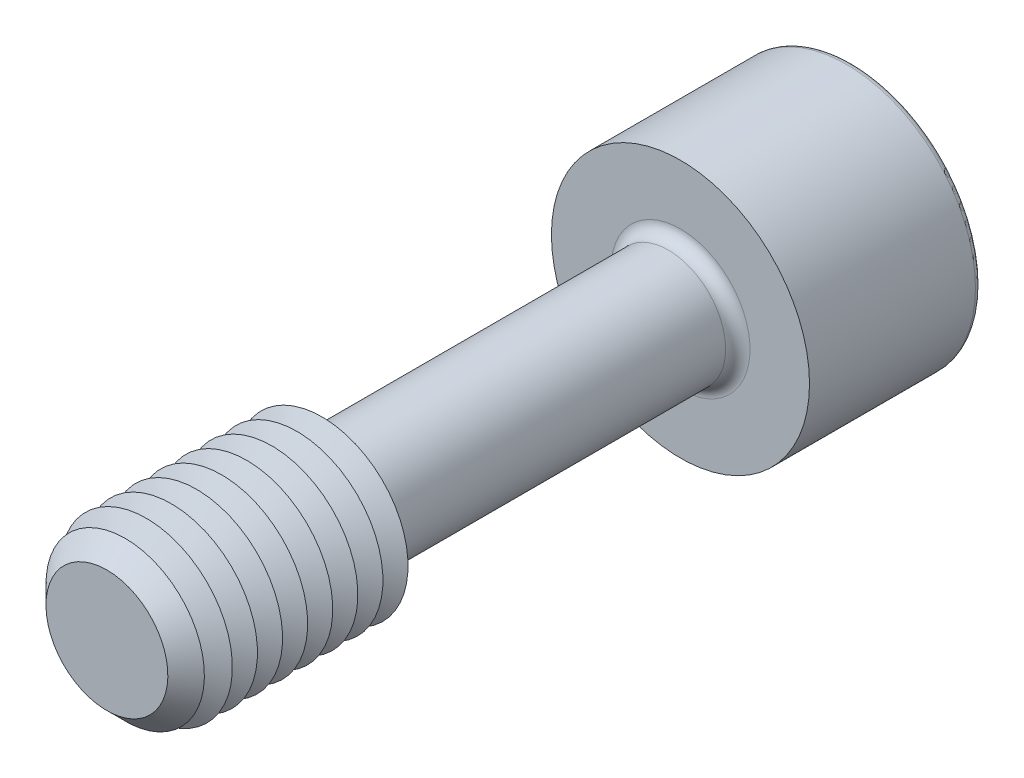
ISO-10303-21;
HEADER;
FILE_DESCRIPTION(('STEP AP214'),'2;1');
FILE_NAME('part.step','',(''),(''),'','','');
FILE_SCHEMA(('AUTOMOTIVE_DESIGN { 1 0 10303 214 1 1 1 1 }'));
ENDSEC;
DATA;
#1=APPLICATION_CONTEXT('core data for automotive mechanical design processes');
#2=APPLICATION_PROTOCOL_DEFINITION('international standard','automotive_design',2000,#1);
#3=PRODUCT_CONTEXT('',#1,'mechanical');
#4=PRODUCT('Part','Part','',(#3));
#5=PRODUCT_RELATED_PRODUCT_CATEGORY('part','',(#4));
#6=PRODUCT_DEFINITION_FORMATION('','',#4);
#7=PRODUCT_DEFINITION_CONTEXT('part definition',#1,'design');
#8=PRODUCT_DEFINITION('design','',#6,#7);
#9=PRODUCT_DEFINITION_SHAPE('','',#8);
#10=(LENGTH_UNIT() NAMED_UNIT(*) SI_UNIT(.MILLI.,.METRE.));
#11=(NAMED_UNIT(*) PLANE_ANGLE_UNIT() SI_UNIT($,.RADIAN.));
#12=(NAMED_UNIT(*) SI_UNIT($,.STERADIAN.) SOLID_ANGLE_UNIT());
#13=UNCERTAINTY_MEASURE_WITH_UNIT(LENGTH_MEASURE(1.E-05),#10,'distance_accuracy_value','');
#14=(GEOMETRIC_REPRESENTATION_CONTEXT(3) GLOBAL_UNCERTAINTY_ASSIGNED_CONTEXT((#13)) GLOBAL_UNIT_ASSIGNED_CONTEXT((#10,
#11,#12)) REPRESENTATION_CONTEXT('',''));
#15=CARTESIAN_POINT('',(0.,0.,0.));
#16=DIRECTION('',(0.,0.,1.));
#17=DIRECTION('',(1.,0.,0.));
#18=AXIS2_PLACEMENT_3D('',#15,#16,#17);
#19=CARTESIAN_POINT('',(-2.88675134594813,-5.,-22.));
#20=DIRECTION('',(0.,0.,1.));
#21=DIRECTION('',(1.,0.,0.));
#22=AXIS2_PLACEMENT_3D('',#19,#20,#21);
#23=PLANE('',#22);
#24=DIRECTION('',(1.,0.,0.));
#25=VECTOR('',#24,1.);
#26=CARTESIAN_POINT('',(-2.88675134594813,-5.,-22.));
#27=LINE('',#26,#25);
#28=CARTESIAN_POINT('',(0.,-5.,-22.));
#29=VERTEX_POINT('',#28);
#30=CARTESIAN_POINT('',(2.88675134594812,-5.,-22.));
#31=VERTEX_POINT('',#30);
#32=EDGE_CURVE('E761',#29,#31,#27,.T.);
#33=ORIENTED_EDGE('',*,*,#32,.F.);
#34=CARTESIAN_POINT('',(0.,0.,-22.));
#35=DIRECTION('',(0.,0.,1.));
#36=DIRECTION('',(0.,-1.,0.));
#37=AXIS2_PLACEMENT_3D('',#34,#35,#36);
#38=CIRCLE('',#37,5.);
#39=CARTESIAN_POINT('',(4.3301270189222,-2.5,-22.));
#40=VERTEX_POINT('',#39);
#41=EDGE_CURVE('E53',#29,#40,#38,.T.);
#42=ORIENTED_EDGE('',*,*,#41,.T.);
#43=DIRECTION('',(0.5,0.866025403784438,0.));
#44=VECTOR('',#43,1.);
#45=CARTESIAN_POINT('',(2.88675134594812,-5.,-22.));
#46=LINE('',#45,#44);
#47=EDGE_CURVE('E746',#31,#40,#46,.T.);
#48=ORIENTED_EDGE('',*,*,#47,.F.);
#49=EDGE_LOOP('',(#33,#42,#48));
#50=FACE_BOUND('',#49,.T.);
#51=ADVANCED_FACE('F41',(#50),#23,.F.);
#52=CARTESIAN_POINT('',(5.77350269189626,0.,-22.));
#53=VERTEX_POINT('',#52);
#54=EDGE_CURVE('E757',#40,#53,#46,.T.);
#55=ORIENTED_EDGE('',*,*,#54,.F.);
#56=CARTESIAN_POINT('',(4.3301270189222,2.50000000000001,-22.));
#57=VERTEX_POINT('',#56);
#58=EDGE_CURVE('E11',#40,#57,#38,.T.);
#59=ORIENTED_EDGE('',*,*,#58,.T.);
#60=DIRECTION('',(-0.5,0.866025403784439,0.));
#61=VECTOR('',#60,1.);
#62=CARTESIAN_POINT('',(5.77350269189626,0.,-22.));
#63=LINE('',#62,#61);
#64=EDGE_CURVE('E745',#53,#57,#63,.T.);
#65=ORIENTED_EDGE('',*,*,#64,.F.);
#66=EDGE_LOOP('',(#55,#59,#65));
#67=FACE_BOUND('',#66,.T.);
#68=ADVANCED_FACE('F133',(#67),#23,.F.);
#69=CARTESIAN_POINT('',(2.88675134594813,5.,-22.));
#70=VERTEX_POINT('',#69);
#71=EDGE_CURVE('E741',#57,#70,#63,.T.);
#72=ORIENTED_EDGE('',*,*,#71,.F.);
#73=CARTESIAN_POINT('',(0.,5.00000000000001,-22.));
#74=VERTEX_POINT('',#73);
#75=EDGE_CURVE('E51',#57,#74,#38,.T.);
#76=ORIENTED_EDGE('',*,*,#75,.T.);
#77=DIRECTION('',(-1.,0.,0.));
#78=VECTOR('',#77,1.);
#79=CARTESIAN_POINT('',(2.88675134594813,5.,-22.));
#80=LINE('',#79,#78);
#81=EDGE_CURVE('E177',#70,#74,#80,.T.);
#82=ORIENTED_EDGE('',*,*,#81,.F.);
#83=EDGE_LOOP('',(#72,#76,#82));
#84=FACE_BOUND('',#83,.T.);
#85=ADVANCED_FACE('F139',(#84),#23,.F.);
#86=CARTESIAN_POINT('',(-2.88675134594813,5.,-22.));
#87=VERTEX_POINT('',#86);
#88=EDGE_CURVE('E751',#74,#87,#80,.T.);
#89=ORIENTED_EDGE('',*,*,#88,.F.);
#90=CARTESIAN_POINT('',(-4.3301270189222,2.50000000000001,-22.));
#91=VERTEX_POINT('',#90);
#92=EDGE_CURVE('E264',#74,#91,#38,.T.);
#93=ORIENTED_EDGE('',*,*,#92,.T.);
#94=DIRECTION('',(-0.5,-0.866025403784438,0.));
#95=VECTOR('',#94,1.);
#96=CARTESIAN_POINT('',(-2.88675134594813,5.,-22.));
#97=LINE('',#96,#95);
#98=EDGE_CURVE('E176',#87,#91,#97,.T.);
#99=ORIENTED_EDGE('',*,*,#98,.F.);
#100=EDGE_LOOP('',(#89,#93,#99));
#101=FACE_BOUND('',#100,.T.);
#102=ADVANCED_FACE('F157',(#101),#23,.F.);
#103=CARTESIAN_POINT('',(-5.77350269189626,0.,-22.));
#104=VERTEX_POINT('',#103);
#105=EDGE_CURVE('E170',#91,#104,#97,.T.);
#106=ORIENTED_EDGE('',*,*,#105,.F.);
#107=CARTESIAN_POINT('',(-4.3301270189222,-2.5,-22.));
#108=VERTEX_POINT('',#107);
#109=EDGE_CURVE('E172',#91,#108,#38,.T.);
#110=ORIENTED_EDGE('',*,*,#109,.T.);
#111=DIRECTION('',(0.5,-0.866025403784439,0.));
#112=VECTOR('',#111,1.);
#113=CARTESIAN_POINT('',(-5.77350269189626,0.,-22.));
#114=LINE('',#113,#112);
#115=EDGE_CURVE('E174',#104,#108,#114,.T.);
#116=ORIENTED_EDGE('',*,*,#115,.F.);
#117=EDGE_LOOP('',(#106,#110,#116));
#118=FACE_BOUND('',#117,.T.);
#119=ADVANCED_FACE('F146',(#118),#23,.F.);
#120=CARTESIAN_POINT('',(0.,0.,-32.));
#121=DIRECTION('',(0.,0.,-1.));
#122=DIRECTION('',(-1.,0.,0.));
#123=AXIS2_PLACEMENT_3D('',#120,#121,#122);
#124=PLANE('',#123);
#125=CARTESIAN_POINT('',(0.,0.,-32.));
#126=DIRECTION('',(0.,0.,-1.));
#127=DIRECTION('',(-1.,0.,0.));
#128=AXIS2_PLACEMENT_3D('',#125,#126,#127);
#129=CIRCLE('',#128,8.575);
#130=CARTESIAN_POINT('',(-8.575,0.,-32.));
#131=VERTEX_POINT('',#130);
#132=EDGE_CURVE('E250',#131,#131,#129,.T.);
#133=ORIENTED_EDGE('',*,*,#132,.T.);
#134=EDGE_LOOP('',(#133));
#135=FACE_BOUND('',#134,.T.);
#136=DIRECTION('',(-0.5,-0.866025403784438,0.));
#137=VECTOR('',#136,1.);
#138=CARTESIAN_POINT('',(-2.88675134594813,5.,-32.));
#139=LINE('',#138,#137);
#140=CARTESIAN_POINT('',(-2.88675134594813,5.,-32.));
#141=VERTEX_POINT('',#140);
#142=CARTESIAN_POINT('',(-5.77350269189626,0.,-32.));
#143=VERTEX_POINT('',#142);
#144=EDGE_CURVE('E212',#141,#143,#139,.T.);
#145=ORIENTED_EDGE('',*,*,#144,.T.);
#146=DIRECTION('',(0.5,-0.866025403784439,0.));
#147=VECTOR('',#146,1.);
#148=CARTESIAN_POINT('',(-5.77350269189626,0.,-32.));
#149=LINE('',#148,#147);
#150=CARTESIAN_POINT('',(-2.88675134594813,-5.,-32.));
#151=VERTEX_POINT('',#150);
#152=EDGE_CURVE('E67',#143,#151,#149,.T.);
#153=ORIENTED_EDGE('',*,*,#152,.T.);
#154=DIRECTION('',(1.,0.,0.));
#155=VECTOR('',#154,1.);
#156=CARTESIAN_POINT('',(-2.88675134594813,-5.,-32.));
#157=LINE('',#156,#155);
#158=CARTESIAN_POINT('',(2.88675134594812,-5.,-32.));
#159=VERTEX_POINT('',#158);
#160=EDGE_CURVE('E196',#151,#159,#157,.T.);
#161=ORIENTED_EDGE('',*,*,#160,.T.);
#162=DIRECTION('',(0.5,0.866025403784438,0.));
#163=VECTOR('',#162,1.);
#164=CARTESIAN_POINT('',(2.88675134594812,-5.,-32.));
#165=LINE('',#164,#163);
#166=CARTESIAN_POINT('',(5.77350269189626,0.,-32.));
#167=VERTEX_POINT('',#166);
#168=EDGE_CURVE('E200',#159,#167,#165,.T.);
#169=ORIENTED_EDGE('',*,*,#168,.T.);
#170=DIRECTION('',(-0.5,0.866025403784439,0.));
#171=VECTOR('',#170,1.);
#172=CARTESIAN_POINT('',(5.77350269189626,0.,-32.));
#173=LINE('',#172,#171);
#174=CARTESIAN_POINT('',(2.88675134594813,5.,-32.));
#175=VERTEX_POINT('',#174);
#176=EDGE_CURVE('E204',#167,#175,#173,.T.);
#177=ORIENTED_EDGE('',*,*,#176,.T.);
#178=DIRECTION('',(-1.,0.,0.));
#179=VECTOR('',#178,1.);
#180=CARTESIAN_POINT('',(2.88675134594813,5.,-32.));
#181=LINE('',#180,#179);
#182=EDGE_CURVE('E208',#175,#141,#181,.T.);
#183=ORIENTED_EDGE('',*,*,#182,.T.);
#184=EDGE_LOOP('',(#145,#153,#161,#169,#177,#183));
#185=FACE_BOUND('',#184,.T.);
#186=ADVANCED_FACE('F156',(#135,#185),#124,.T.);
#187=CARTESIAN_POINT('',(0.,0.,20.));
#188=DIRECTION('',(0.,0.,-1.));
#189=DIRECTION('',(-1.,0.,0.));
#190=AXIS2_PLACEMENT_3D('',#187,#188,#189);
#191=CYLINDRICAL_SURFACE('',#190,4.);
#192=CARTESIAN_POINT('',(0.,0.,-19.15));
#193=DIRECTION('',(0.,0.,-1.));
#194=DIRECTION('',(-1.,0.,0.));
#195=AXIS2_PLACEMENT_3D('',#192,#193,#194);
#196=CIRCLE('',#195,4.);
#197=CARTESIAN_POINT('',(-4.,0.,-19.15));
#198=VERTEX_POINT('',#197);
#199=EDGE_CURVE('E246',#198,#198,#196,.F.);
#200=ORIENTED_EDGE('',*,*,#199,.T.);
#201=EDGE_LOOP('',(#200));
#202=FACE_BOUND('',#201,.T.);
#203=CARTESIAN_POINT('',(0.,0.,3.84529946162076));
#204=DIRECTION('',(0.,0.,-1.));
#205=DIRECTION('',(0.,1.,0.));
#206=AXIS2_PLACEMENT_3D('',#203,#204,#205);
#207=CIRCLE('',#206,4.);
#208=CARTESIAN_POINT('',(0.,4.,3.84529946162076));
#209=VERTEX_POINT('',#208);
#210=EDGE_CURVE('E234',#209,#209,#207,.T.);
#211=ORIENTED_EDGE('',*,*,#210,.T.);
#212=EDGE_LOOP('',(#211));
#213=FACE_BOUND('',#212,.T.);
#214=ADVANCED_FACE('F163',(#202,#213),#191,.T.);
#215=CARTESIAN_POINT('',(0.,0.,3.84529946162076));
#216=DIRECTION('',(0.,0.,1.));
#217=DIRECTION('',(0.,-1.,0.));
#218=AXIS2_PLACEMENT_3D('',#215,#216,#217);
#219=CONICAL_SURFACE('',#218,4.,1.0471975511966);
#220=CARTESIAN_POINT('',(0.,0.,5.));
#221=DIRECTION('',(0.,0.,-1.));
#222=DIRECTION('',(-1.,0.,0.));
#223=AXIS2_PLACEMENT_3D('',#220,#221,#222);
#224=CIRCLE('',#223,6.);
#225=CARTESIAN_POINT('',(-6.,0.,5.));
#226=VERTEX_POINT('',#225);
#227=EDGE_CURVE('E268',#226,#226,#224,.T.);
#228=ORIENTED_EDGE('',*,*,#227,.T.);
#229=EDGE_LOOP('',(#228));
#230=FACE_BOUND('',#229,.T.);
#231=ORIENTED_EDGE('',*,*,#210,.F.);
#232=EDGE_LOOP('',(#231));
#233=FACE_BOUND('',#232,.T.);
#234=ADVANCED_FACE('F510',(#230,#233),#219,.T.);
#235=CARTESIAN_POINT('',(0.,0.,-20.));
#236=DIRECTION('',(0.,0.,-1.));
#237=DIRECTION('',(-1.,0.,0.));
#238=AXIS2_PLACEMENT_3D('',#235,#236,#237);
#239=PLANE('',#238);
#240=CARTESIAN_POINT('',(0.,0.,-20.));
#241=DIRECTION('',(0.,0.,-1.));
#242=DIRECTION('',(-1.,0.,0.));
#243=AXIS2_PLACEMENT_3D('',#240,#241,#242);
#244=CIRCLE('',#243,4.85);
#245=CARTESIAN_POINT('',(-4.85,0.,-20.));
#246=VERTEX_POINT('',#245);
#247=EDGE_CURVE('E242',#246,#246,#244,.T.);
#248=ORIENTED_EDGE('',*,*,#247,.T.);
#249=EDGE_LOOP('',(#248));
#250=FACE_BOUND('',#249,.T.);
#251=CARTESIAN_POINT('',(0.,0.,-20.));
#252=DIRECTION('',(0.,0.,-1.));
#253=DIRECTION('',(-1.,0.,0.));
#254=AXIS2_PLACEMENT_3D('',#251,#252,#253);
#255=CIRCLE('',#254,9.);
#256=CARTESIAN_POINT('',(-9.,0.,-20.));
#257=VERTEX_POINT('',#256);
#258=EDGE_CURVE('E230',#257,#257,#255,.T.);
#259=ORIENTED_EDGE('',*,*,#258,.F.);
#260=EDGE_LOOP('',(#259));
#261=FACE_BOUND('',#260,.T.);
#262=ADVANCED_FACE('F503',(#250,#261),#239,.F.);
#263=CARTESIAN_POINT('',(0.,0.,-32.));
#264=DIRECTION('',(0.,0.,1.));
#265=DIRECTION('',(1.,0.,0.));
#266=AXIS2_PLACEMENT_3D('',#263,#264,#265);
#267=CYLINDRICAL_SURFACE('',#266,9.);
#268=CARTESIAN_POINT('',(0.,0.,-31.575));
#269=DIRECTION('',(0.,0.,-1.));
#270=DIRECTION('',(-1.,0.,0.));
#271=AXIS2_PLACEMENT_3D('',#268,#269,#270);
#272=CIRCLE('',#271,9.);
#273=CARTESIAN_POINT('',(-9.,0.,-31.575));
#274=VERTEX_POINT('',#273);
#275=EDGE_CURVE('E253',#274,#274,#272,.F.);
#276=ORIENTED_EDGE('',*,*,#275,.T.);
#277=EDGE_LOOP('',(#276));
#278=FACE_BOUND('',#277,.T.);
#279=ORIENTED_EDGE('',*,*,#258,.T.);
#280=EDGE_LOOP('',(#279));
#281=FACE_BOUND('',#280,.T.);
#282=ADVANCED_FACE('F509',(#278,#281),#267,.T.);
#283=CARTESIAN_POINT('',(-5.77350269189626,0.,-22.));
#284=DIRECTION('',(0.866025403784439,0.5,0.));
#285=DIRECTION('',(-0.5,0.866025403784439,0.));
#286=AXIS2_PLACEMENT_3D('',#283,#284,#285);
#287=PLANE('',#286);
#288=ORIENTED_EDGE('',*,*,#152,.F.);
#289=DIRECTION('',(0.,0.,-1.));
#290=VECTOR('',#289,1.);
#291=CARTESIAN_POINT('',(-5.77350269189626,0.,-22.));
#292=LINE('',#291,#290);
#293=EDGE_CURVE('E186',#104,#143,#292,.T.);
#294=ORIENTED_EDGE('',*,*,#293,.F.);
#295=ORIENTED_EDGE('',*,*,#115,.T.);
#296=CARTESIAN_POINT('',(-2.88675134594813,-5.,-22.));
#297=VERTEX_POINT('',#296);
#298=EDGE_CURVE('E215',#108,#297,#114,.T.);
#299=ORIENTED_EDGE('',*,*,#298,.T.);
#300=DIRECTION('',(0.,0.,-1.));
#301=VECTOR('',#300,1.);
#302=CARTESIAN_POINT('',(-2.88675134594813,-5.,-22.));
#303=LINE('',#302,#301);
#304=EDGE_CURVE('E227',#297,#151,#303,.T.);
#305=ORIENTED_EDGE('',*,*,#304,.T.);
#306=EDGE_LOOP('',(#288,#294,#295,#299,#305));
#307=FACE_BOUND('',#306,.T.);
#308=ADVANCED_FACE('F521',(#307),#287,.T.);
#309=CARTESIAN_POINT('',(-2.88675134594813,-5.,-22.));
#310=DIRECTION('',(0.,1.,0.));
#311=DIRECTION('',(0.,0.,1.));
#312=AXIS2_PLACEMENT_3D('',#309,#310,#311);
#313=PLANE('',#312);
#314=ORIENTED_EDGE('',*,*,#160,.F.);
#315=ORIENTED_EDGE('',*,*,#304,.F.);
#316=EDGE_CURVE('E758',#297,#29,#27,.T.);
#317=ORIENTED_EDGE('',*,*,#316,.T.);
#318=ORIENTED_EDGE('',*,*,#32,.T.);
#319=DIRECTION('',(0.,0.,-1.));
#320=VECTOR('',#319,1.);
#321=CARTESIAN_POINT('',(2.88675134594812,-5.,-22.));
#322=LINE('',#321,#320);
#323=EDGE_CURVE('E224',#31,#159,#322,.T.);
#324=ORIENTED_EDGE('',*,*,#323,.T.);
#325=EDGE_LOOP('',(#314,#315,#317,#318,#324));
#326=FACE_BOUND('',#325,.T.);
#327=ADVANCED_FACE('F537',(#326),#313,.T.);
#328=CARTESIAN_POINT('',(2.88675134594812,-5.,-22.));
#329=DIRECTION('',(-0.866025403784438,0.5,0.));
#330=DIRECTION('',(-0.5,-0.866025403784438,0.));
#331=AXIS2_PLACEMENT_3D('',#328,#329,#330);
#332=PLANE('',#331);
#333=ORIENTED_EDGE('',*,*,#168,.F.);
#334=ORIENTED_EDGE('',*,*,#323,.F.);
#335=ORIENTED_EDGE('',*,*,#47,.T.);
#336=ORIENTED_EDGE('',*,*,#54,.T.);
#337=DIRECTION('',(0.,0.,-1.));
#338=VECTOR('',#337,1.);
#339=CARTESIAN_POINT('',(5.77350269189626,0.,-22.));
#340=LINE('',#339,#338);
#341=EDGE_CURVE('E221',#53,#167,#340,.T.);
#342=ORIENTED_EDGE('',*,*,#341,.T.);
#343=EDGE_LOOP('',(#333,#334,#335,#336,#342));
#344=FACE_BOUND('',#343,.T.);
#345=ADVANCED_FACE('F547',(#344),#332,.T.);
#346=CARTESIAN_POINT('',(5.77350269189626,0.,-22.));
#347=DIRECTION('',(-0.866025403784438,-0.5,0.));
#348=DIRECTION('',(0.5,-0.866025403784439,0.));
#349=AXIS2_PLACEMENT_3D('',#346,#347,#348);
#350=PLANE('',#349);
#351=ORIENTED_EDGE('',*,*,#176,.F.);
#352=ORIENTED_EDGE('',*,*,#341,.F.);
#353=ORIENTED_EDGE('',*,*,#64,.T.);
#354=ORIENTED_EDGE('',*,*,#71,.T.);
#355=DIRECTION('',(0.,0.,-1.));
#356=VECTOR('',#355,1.);
#357=CARTESIAN_POINT('',(2.88675134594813,5.,-22.));
#358=LINE('',#357,#356);
#359=EDGE_CURVE('E218',#70,#175,#358,.T.);
#360=ORIENTED_EDGE('',*,*,#359,.T.);
#361=EDGE_LOOP('',(#351,#352,#353,#354,#360));
#362=FACE_BOUND('',#361,.T.);
#363=ADVANCED_FACE('F557',(#362),#350,.T.);
#364=CARTESIAN_POINT('',(2.88675134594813,5.,-22.));
#365=DIRECTION('',(0.,-1.,0.));
#366=DIRECTION('',(0.,0.,-1.));
#367=AXIS2_PLACEMENT_3D('',#364,#365,#366);
#368=PLANE('',#367);
#369=ORIENTED_EDGE('',*,*,#182,.F.);
#370=ORIENTED_EDGE('',*,*,#359,.F.);
#371=ORIENTED_EDGE('',*,*,#81,.T.);
#372=ORIENTED_EDGE('',*,*,#88,.T.);
#373=DIRECTION('',(0.,0.,-1.));
#374=VECTOR('',#373,1.);
#375=CARTESIAN_POINT('',(-2.88675134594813,5.,-22.));
#376=LINE('',#375,#374);
#377=EDGE_CURVE('E182',#87,#141,#376,.T.);
#378=ORIENTED_EDGE('',*,*,#377,.T.);
#379=EDGE_LOOP('',(#369,#370,#371,#372,#378));
#380=FACE_BOUND('',#379,.T.);
#381=ADVANCED_FACE('F152',(#380),#368,.T.);
#382=CARTESIAN_POINT('',(-2.88675134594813,5.,-22.));
#383=DIRECTION('',(0.866025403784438,-0.5,0.));
#384=DIRECTION('',(0.5,0.866025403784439,0.));
#385=AXIS2_PLACEMENT_3D('',#382,#383,#384);
#386=PLANE('',#385);
#387=ORIENTED_EDGE('',*,*,#144,.F.);
#388=ORIENTED_EDGE('',*,*,#377,.F.);
#389=ORIENTED_EDGE('',*,*,#98,.T.);
#390=ORIENTED_EDGE('',*,*,#105,.T.);
#391=ORIENTED_EDGE('',*,*,#293,.T.);
#392=EDGE_LOOP('',(#387,#388,#389,#390,#391));
#393=FACE_BOUND('',#392,.T.);
#394=ADVANCED_FACE('F144',(#393),#386,.T.);
#395=ORIENTED_EDGE('',*,*,#298,.F.);
#396=EDGE_CURVE('E256',#108,#29,#38,.T.);
#397=ORIENTED_EDGE('',*,*,#396,.T.);
#398=ORIENTED_EDGE('',*,*,#316,.F.);
#399=EDGE_LOOP('',(#395,#397,#398));
#400=FACE_BOUND('',#399,.T.);
#401=ADVANCED_FACE('F135',(#400),#23,.F.);
#402=CARTESIAN_POINT('',(0.,0.,-19.15));
#403=DIRECTION('',(0.,0.,-1.));
#404=DIRECTION('',(-1.,0.,0.));
#405=AXIS2_PLACEMENT_3D('',#402,#403,#404);
#406=TOROIDAL_SURFACE('',#405,4.85,0.85);
#407=ORIENTED_EDGE('',*,*,#199,.F.);
#408=EDGE_LOOP('',(#407));
#409=FACE_BOUND('',#408,.T.);
#410=ORIENTED_EDGE('',*,*,#247,.F.);
#411=EDGE_LOOP('',(#410));
#412=FACE_BOUND('',#411,.T.);
#413=ADVANCED_FACE('F129',(#409,#412),#406,.F.);
#414=CARTESIAN_POINT('',(0.,0.,-31.575));
#415=DIRECTION('',(0.,0.,-1.));
#416=DIRECTION('',(-1.,0.,0.));
#417=AXIS2_PLACEMENT_3D('',#414,#415,#416);
#418=TOROIDAL_SURFACE('',#417,8.575,0.425);
#419=ORIENTED_EDGE('',*,*,#275,.F.);
#420=EDGE_LOOP('',(#419));
#421=FACE_BOUND('',#420,.T.);
#422=ORIENTED_EDGE('',*,*,#132,.F.);
#423=EDGE_LOOP('',(#422));
#424=FACE_BOUND('',#423,.T.);
#425=ADVANCED_FACE('F43',(#421,#424),#418,.T.);
#426=CARTESIAN_POINT('',(0.,0.,-19.1132486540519));
#427=DIRECTION('',(0.,0.,-1.));
#428=DIRECTION('',(0.,1.,0.));
#429=AXIS2_PLACEMENT_3D('',#426,#427,#428);
#430=CONICAL_SURFACE('',#429,0.,1.04719755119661);
#431=ORIENTED_EDGE('',*,*,#41,.F.);
#432=ORIENTED_EDGE('',*,*,#396,.F.);
#433=ORIENTED_EDGE('',*,*,#109,.F.);
#434=ORIENTED_EDGE('',*,*,#92,.F.);
#435=ORIENTED_EDGE('',*,*,#75,.F.);
#436=ORIENTED_EDGE('',*,*,#58,.F.);
#437=EDGE_LOOP('',(#431,#432,#433,#434,#435,#436));
#438=FACE_BOUND('',#437,.T.);
#439=CARTESIAN_POINT('',(0.,0.,-19.1132486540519));
#440=VERTEX_POINT('',#439);
#441=VERTEX_LOOP('',#440);
#442=FACE_BOUND('',#441,.T.);
#443=ADVANCED_FACE('F118',(#438,#442),#430,.F.);
#444=CARTESIAN_POINT('',(0.,0.,5.875));
#445=DIRECTION('',(0.,0.,-1.));
#446=DIRECTION('',(-1.,0.,0.));
#447=AXIS2_PLACEMENT_3D('',#444,#445,#446);
#448=CONICAL_SURFACE('',#447,4.48445554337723,1.0471975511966);
#449=ORIENTED_EDGE('',*,*,#227,.F.);
#450=EDGE_LOOP('',(#449));
#451=FACE_BOUND('',#450,.T.);
#452=CARTESIAN_POINT('',(0.,0.,5.875));
#453=DIRECTION('',(0.,0.,-1.));
#454=DIRECTION('',(-1.,0.,0.));
#455=AXIS2_PLACEMENT_3D('',#452,#453,#454);
#456=CIRCLE('',#455,4.48445554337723);
#457=CARTESIAN_POINT('',(-4.48445554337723,0.,5.875));
#458=VERTEX_POINT('',#457);
#459=EDGE_CURVE('E274',#458,#458,#456,.T.);
#460=ORIENTED_EDGE('',*,*,#459,.T.);
#461=EDGE_LOOP('',(#460));
#462=FACE_BOUND('',#461,.T.);
#463=ADVANCED_FACE('F120',(#451,#462),#448,.T.);
#464=CARTESIAN_POINT('',(0.,0.,6.75));
#465=DIRECTION('',(0.,0.,1.));
#466=DIRECTION('',(1.,0.,0.));
#467=AXIS2_PLACEMENT_3D('',#464,#465,#466);
#468=CONICAL_SURFACE('',#467,6.,1.0471975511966);
#469=ORIENTED_EDGE('',*,*,#459,.F.);
#470=EDGE_LOOP('',(#469));
#471=FACE_BOUND('',#470,.T.);
#472=CARTESIAN_POINT('',(0.,0.,6.75));
#473=DIRECTION('',(0.,0.,-1.));
#474=DIRECTION('',(-1.,0.,0.));
#475=AXIS2_PLACEMENT_3D('',#472,#473,#474);
#476=CIRCLE('',#475,6.);
#477=CARTESIAN_POINT('',(-6.,0.,6.75));
#478=VERTEX_POINT('',#477);
#479=EDGE_CURVE('E279',#478,#478,#476,.T.);
#480=ORIENTED_EDGE('',*,*,#479,.T.);
#481=EDGE_LOOP('',(#480));
#482=FACE_BOUND('',#481,.T.);
#483=ADVANCED_FACE('F126',(#471,#482),#468,.T.);
#484=CARTESIAN_POINT('',(0.,0.,7.625));
#485=DIRECTION('',(0.,0.,-1.));
#486=DIRECTION('',(-1.,0.,0.));
#487=AXIS2_PLACEMENT_3D('',#484,#485,#486);
#488=CONICAL_SURFACE('',#487,4.48445554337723,1.0471975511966);
#489=ORIENTED_EDGE('',*,*,#479,.F.);
#490=EDGE_LOOP('',(#489));
#491=FACE_BOUND('',#490,.T.);
#492=CARTESIAN_POINT('',(0.,0.,7.625));
#493=DIRECTION('',(0.,0.,-1.));
#494=DIRECTION('',(-1.,0.,0.));
#495=AXIS2_PLACEMENT_3D('',#492,#493,#494);
#496=CIRCLE('',#495,4.48445554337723);
#497=CARTESIAN_POINT('',(-4.48445554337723,0.,7.625));
#498=VERTEX_POINT('',#497);
#499=EDGE_CURVE('E285',#498,#498,#496,.T.);
#500=ORIENTED_EDGE('',*,*,#499,.T.);
#501=EDGE_LOOP('',(#500));
#502=FACE_BOUND('',#501,.T.);
#503=ADVANCED_FACE('F397',(#491,#502),#488,.T.);
#504=CARTESIAN_POINT('',(0.,0.,8.5));
#505=DIRECTION('',(0.,0.,1.));
#506=DIRECTION('',(1.,0.,0.));
#507=AXIS2_PLACEMENT_3D('',#504,#505,#506);
#508=CONICAL_SURFACE('',#507,6.,1.0471975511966);
#509=ORIENTED_EDGE('',*,*,#499,.F.);
#510=EDGE_LOOP('',(#509));
#511=FACE_BOUND('',#510,.T.);
#512=CARTESIAN_POINT('',(0.,0.,8.5));
#513=DIRECTION('',(0.,0.,-1.));
#514=DIRECTION('',(-1.,0.,0.));
#515=AXIS2_PLACEMENT_3D('',#512,#513,#514);
#516=CIRCLE('',#515,6.);
#517=CARTESIAN_POINT('',(-6.,0.,8.5));
#518=VERTEX_POINT('',#517);
#519=EDGE_CURVE('E288',#518,#518,#516,.T.);
#520=ORIENTED_EDGE('',*,*,#519,.T.);
#521=EDGE_LOOP('',(#520));
#522=FACE_BOUND('',#521,.T.);
#523=ADVANCED_FACE('F393',(#511,#522),#508,.T.);
#524=CARTESIAN_POINT('',(0.,0.,9.375));
#525=DIRECTION('',(0.,0.,-1.));
#526=DIRECTION('',(-1.,0.,0.));
#527=AXIS2_PLACEMENT_3D('',#524,#525,#526);
#528=CONICAL_SURFACE('',#527,4.48445554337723,1.0471975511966);
#529=ORIENTED_EDGE('',*,*,#519,.F.);
#530=EDGE_LOOP('',(#529));
#531=FACE_BOUND('',#530,.T.);
#532=CARTESIAN_POINT('',(0.,0.,9.375));
#533=DIRECTION('',(0.,0.,-1.));
#534=DIRECTION('',(-1.,0.,0.));
#535=AXIS2_PLACEMENT_3D('',#532,#533,#534);
#536=CIRCLE('',#535,4.48445554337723);
#537=CARTESIAN_POINT('',(-4.48445554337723,0.,9.375));
#538=VERTEX_POINT('',#537);
#539=EDGE_CURVE('E292',#538,#538,#536,.T.);
#540=ORIENTED_EDGE('',*,*,#539,.T.);
#541=EDGE_LOOP('',(#540));
#542=FACE_BOUND('',#541,.T.);
#543=ADVANCED_FACE('F389',(#531,#542),#528,.T.);
#544=CARTESIAN_POINT('',(0.,0.,10.25));
#545=DIRECTION('',(0.,0.,1.));
#546=DIRECTION('',(1.,0.,0.));
#547=AXIS2_PLACEMENT_3D('',#544,#545,#546);
#548=CONICAL_SURFACE('',#547,6.,1.0471975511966);
#549=ORIENTED_EDGE('',*,*,#539,.F.);
#550=EDGE_LOOP('',(#549));
#551=FACE_BOUND('',#550,.T.);
#552=CARTESIAN_POINT('',(0.,0.,10.25));
#553=DIRECTION('',(0.,0.,-1.));
#554=DIRECTION('',(-1.,0.,0.));
#555=AXIS2_PLACEMENT_3D('',#552,#553,#554);
#556=CIRCLE('',#555,6.);
#557=CARTESIAN_POINT('',(-6.,0.,10.25));
#558=VERTEX_POINT('',#557);
#559=EDGE_CURVE('E296',#558,#558,#556,.T.);
#560=ORIENTED_EDGE('',*,*,#559,.T.);
#561=EDGE_LOOP('',(#560));
#562=FACE_BOUND('',#561,.T.);
#563=ADVANCED_FACE('F385',(#551,#562),#548,.T.);
#564=CARTESIAN_POINT('',(0.,0.,11.125));
#565=DIRECTION('',(0.,0.,-1.));
#566=DIRECTION('',(-1.,0.,0.));
#567=AXIS2_PLACEMENT_3D('',#564,#565,#566);
#568=CONICAL_SURFACE('',#567,4.48445554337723,1.0471975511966);
#569=ORIENTED_EDGE('',*,*,#559,.F.);
#570=EDGE_LOOP('',(#569));
#571=FACE_BOUND('',#570,.T.);
#572=CARTESIAN_POINT('',(0.,0.,11.125));
#573=DIRECTION('',(0.,0.,-1.));
#574=DIRECTION('',(-1.,0.,0.));
#575=AXIS2_PLACEMENT_3D('',#572,#573,#574);
#576=CIRCLE('',#575,4.48445554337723);
#577=CARTESIAN_POINT('',(-4.48445554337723,0.,11.125));
#578=VERTEX_POINT('',#577);
#579=EDGE_CURVE('E300',#578,#578,#576,.T.);
#580=ORIENTED_EDGE('',*,*,#579,.T.);
#581=EDGE_LOOP('',(#580));
#582=FACE_BOUND('',#581,.T.);
#583=ADVANCED_FACE('F381',(#571,#582),#568,.T.);
#584=CARTESIAN_POINT('',(0.,0.,12.));
#585=DIRECTION('',(0.,0.,1.));
#586=DIRECTION('',(1.,0.,0.));
#587=AXIS2_PLACEMENT_3D('',#584,#585,#586);
#588=CONICAL_SURFACE('',#587,6.,1.0471975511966);
#589=ORIENTED_EDGE('',*,*,#579,.F.);
#590=EDGE_LOOP('',(#589));
#591=FACE_BOUND('',#590,.T.);
#592=CARTESIAN_POINT('',(0.,0.,12.));
#593=DIRECTION('',(0.,0.,-1.));
#594=DIRECTION('',(-1.,0.,0.));
#595=AXIS2_PLACEMENT_3D('',#592,#593,#594);
#596=CIRCLE('',#595,6.);
#597=CARTESIAN_POINT('',(-6.,0.,12.));
#598=VERTEX_POINT('',#597);
#599=EDGE_CURVE('E304',#598,#598,#596,.T.);
#600=ORIENTED_EDGE('',*,*,#599,.T.);
#601=EDGE_LOOP('',(#600));
#602=FACE_BOUND('',#601,.T.);
#603=ADVANCED_FACE('F377',(#591,#602),#588,.T.);
#604=CARTESIAN_POINT('',(0.,0.,12.875));
#605=DIRECTION('',(0.,0.,-1.));
#606=DIRECTION('',(-1.,0.,0.));
#607=AXIS2_PLACEMENT_3D('',#604,#605,#606);
#608=CONICAL_SURFACE('',#607,4.48445554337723,1.0471975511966);
#609=ORIENTED_EDGE('',*,*,#599,.F.);
#610=EDGE_LOOP('',(#609));
#611=FACE_BOUND('',#610,.T.);
#612=CARTESIAN_POINT('',(0.,0.,12.875));
#613=DIRECTION('',(0.,0.,-1.));
#614=DIRECTION('',(-1.,0.,0.));
#615=AXIS2_PLACEMENT_3D('',#612,#613,#614);
#616=CIRCLE('',#615,4.48445554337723);
#617=CARTESIAN_POINT('',(-4.48445554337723,0.,12.875));
#618=VERTEX_POINT('',#617);
#619=EDGE_CURVE('E308',#618,#618,#616,.T.);
#620=ORIENTED_EDGE('',*,*,#619,.T.);
#621=EDGE_LOOP('',(#620));
#622=FACE_BOUND('',#621,.T.);
#623=ADVANCED_FACE('F373',(#611,#622),#608,.T.);
#624=CARTESIAN_POINT('',(0.,0.,13.75));
#625=DIRECTION('',(0.,0.,1.));
#626=DIRECTION('',(1.,0.,0.));
#627=AXIS2_PLACEMENT_3D('',#624,#625,#626);
#628=CONICAL_SURFACE('',#627,6.,1.0471975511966);
#629=ORIENTED_EDGE('',*,*,#619,.F.);
#630=EDGE_LOOP('',(#629));
#631=FACE_BOUND('',#630,.T.);
#632=CARTESIAN_POINT('',(0.,0.,13.75));
#633=DIRECTION('',(0.,0.,-1.));
#634=DIRECTION('',(-1.,0.,0.));
#635=AXIS2_PLACEMENT_3D('',#632,#633,#634);
#636=CIRCLE('',#635,6.);
#637=CARTESIAN_POINT('',(-6.,0.,13.75));
#638=VERTEX_POINT('',#637);
#639=EDGE_CURVE('E311',#638,#638,#636,.T.);
#640=ORIENTED_EDGE('',*,*,#639,.T.);
#641=EDGE_LOOP('',(#640));
#642=FACE_BOUND('',#641,.T.);
#643=ADVANCED_FACE('F369',(#631,#642),#628,.T.);
#644=CARTESIAN_POINT('',(0.,0.,14.625));
#645=DIRECTION('',(0.,0.,-1.));
#646=DIRECTION('',(-1.,0.,0.));
#647=AXIS2_PLACEMENT_3D('',#644,#645,#646);
#648=CONICAL_SURFACE('',#647,4.48445554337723,1.0471975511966);
#649=ORIENTED_EDGE('',*,*,#639,.F.);
#650=EDGE_LOOP('',(#649));
#651=FACE_BOUND('',#650,.T.);
#652=CARTESIAN_POINT('',(0.,0.,14.625));
#653=DIRECTION('',(0.,0.,-1.));
#654=DIRECTION('',(-1.,0.,0.));
#655=AXIS2_PLACEMENT_3D('',#652,#653,#654);
#656=CIRCLE('',#655,4.48445554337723);
#657=CARTESIAN_POINT('',(-4.48445554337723,0.,14.625));
#658=VERTEX_POINT('',#657);
#659=EDGE_CURVE('E315',#658,#658,#656,.T.);
#660=ORIENTED_EDGE('',*,*,#659,.T.);
#661=EDGE_LOOP('',(#660));
#662=FACE_BOUND('',#661,.T.);
#663=ADVANCED_FACE('F365',(#651,#662),#648,.T.);
#664=CARTESIAN_POINT('',(0.,0.,15.5));
#665=DIRECTION('',(0.,0.,1.));
#666=DIRECTION('',(1.,0.,0.));
#667=AXIS2_PLACEMENT_3D('',#664,#665,#666);
#668=CONICAL_SURFACE('',#667,6.,1.0471975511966);
#669=ORIENTED_EDGE('',*,*,#659,.F.);
#670=EDGE_LOOP('',(#669));
#671=FACE_BOUND('',#670,.T.);
#672=CARTESIAN_POINT('',(0.,0.,15.5));
#673=DIRECTION('',(0.,0.,-1.));
#674=DIRECTION('',(-1.,0.,0.));
#675=AXIS2_PLACEMENT_3D('',#672,#673,#674);
#676=CIRCLE('',#675,6.);
#677=CARTESIAN_POINT('',(-6.,0.,15.5));
#678=VERTEX_POINT('',#677);
#679=EDGE_CURVE('E319',#678,#678,#676,.T.);
#680=ORIENTED_EDGE('',*,*,#679,.T.);
#681=EDGE_LOOP('',(#680));
#682=FACE_BOUND('',#681,.T.);
#683=ADVANCED_FACE('F361',(#671,#682),#668,.T.);
#684=CARTESIAN_POINT('',(0.,0.,16.375));
#685=DIRECTION('',(0.,0.,-1.));
#686=DIRECTION('',(-1.,0.,0.));
#687=AXIS2_PLACEMENT_3D('',#684,#685,#686);
#688=CONICAL_SURFACE('',#687,4.48445554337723,1.0471975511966);
#689=ORIENTED_EDGE('',*,*,#679,.F.);
#690=EDGE_LOOP('',(#689));
#691=FACE_BOUND('',#690,.T.);
#692=CARTESIAN_POINT('',(0.,0.,16.375));
#693=DIRECTION('',(0.,0.,-1.));
#694=DIRECTION('',(-1.,0.,0.));
#695=AXIS2_PLACEMENT_3D('',#692,#693,#694);
#696=CIRCLE('',#695,4.48445554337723);
#697=CARTESIAN_POINT('',(-4.48445554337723,0.,16.375));
#698=VERTEX_POINT('',#697);
#699=EDGE_CURVE('E322',#698,#698,#696,.T.);
#700=ORIENTED_EDGE('',*,*,#699,.T.);
#701=EDGE_LOOP('',(#700));
#702=FACE_BOUND('',#701,.T.);
#703=ADVANCED_FACE('F357',(#691,#702),#688,.T.);
#704=CARTESIAN_POINT('',(0.,0.,17.25));
#705=DIRECTION('',(0.,0.,1.));
#706=DIRECTION('',(1.,0.,0.));
#707=AXIS2_PLACEMENT_3D('',#704,#705,#706);
#708=CONICAL_SURFACE('',#707,6.,1.0471975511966);
#709=ORIENTED_EDGE('',*,*,#699,.F.);
#710=EDGE_LOOP('',(#709));
#711=FACE_BOUND('',#710,.T.);
#712=CARTESIAN_POINT('',(0.,0.,17.25));
#713=DIRECTION('',(0.,0.,-1.));
#714=DIRECTION('',(-1.,0.,0.));
#715=AXIS2_PLACEMENT_3D('',#712,#713,#714);
#716=CIRCLE('',#715,6.);
#717=CARTESIAN_POINT('',(-6.,0.,17.25));
#718=VERTEX_POINT('',#717);
#719=EDGE_CURVE('E326',#718,#718,#716,.T.);
#720=ORIENTED_EDGE('',*,*,#719,.T.);
#721=EDGE_LOOP('',(#720));
#722=FACE_BOUND('',#721,.T.);
#723=ADVANCED_FACE('F350',(#711,#722),#708,.T.);
#724=CARTESIAN_POINT('',(0.,0.,18.125));
#725=DIRECTION('',(0.,0.,-1.));
#726=DIRECTION('',(-1.,0.,0.));
#727=AXIS2_PLACEMENT_3D('',#724,#725,#726);
#728=CONICAL_SURFACE('',#727,4.48445554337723,1.0471975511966);
#729=ORIENTED_EDGE('',*,*,#719,.F.);
#730=EDGE_LOOP('',(#729));
#731=FACE_BOUND('',#730,.T.);
#732=CARTESIAN_POINT('',(0.,0.,18.125));
#733=DIRECTION('',(0.,0.,-1.));
#734=DIRECTION('',(-1.,0.,0.));
#735=AXIS2_PLACEMENT_3D('',#732,#733,#734);
#736=CIRCLE('',#735,4.48445554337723);
#737=CARTESIAN_POINT('',(-4.48445554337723,0.,18.125));
#738=VERTEX_POINT('',#737);
#739=EDGE_CURVE('E330',#738,#738,#736,.T.);
#740=ORIENTED_EDGE('',*,*,#739,.T.);
#741=EDGE_LOOP('',(#740));
#742=FACE_BOUND('',#741,.T.);
#743=ADVANCED_FACE('F336',(#731,#742),#728,.T.);
#744=CARTESIAN_POINT('',(0.,0.,19.));
#745=DIRECTION('',(0.,0.,1.));
#746=DIRECTION('',(1.,0.,0.));
#747=AXIS2_PLACEMENT_3D('',#744,#745,#746);
#748=CONICAL_SURFACE('',#747,6.,1.0471975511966);
#749=CARTESIAN_POINT('',(0.,0.,18.7254809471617));
#750=DIRECTION('',(0.,0.,1.));
#751=DIRECTION('',(1.,0.,0.));
#752=AXIS2_PLACEMENT_3D('',#749,#750,#751);
#753=CIRCLE('',#752,5.52451905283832);
#754=CARTESIAN_POINT('',(0.,5.52451905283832,18.7254809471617));
#755=VERTEX_POINT('',#754);
#756=EDGE_CURVE('E45',#755,#755,#753,.F.);
#757=ORIENTED_EDGE('',*,*,#756,.T.);
#758=EDGE_LOOP('',(#757));
#759=FACE_BOUND('',#758,.T.);
#760=ORIENTED_EDGE('',*,*,#739,.F.);
#761=EDGE_LOOP('',(#760));
#762=FACE_BOUND('',#761,.T.);
#763=ADVANCED_FACE('F338',(#759,#762),#748,.T.);
#764=CARTESIAN_POINT('',(0.,0.,20.));
#765=DIRECTION('',(0.,0.,1.));
#766=DIRECTION('',(1.,0.,0.));
#767=AXIS2_PLACEMENT_3D('',#764,#765,#766);
#768=PLANE('',#767);
#769=CARTESIAN_POINT('',(0.,0.,20.));
#770=DIRECTION('',(0.,0.,1.));
#771=DIRECTION('',(1.,0.,0.));
#772=AXIS2_PLACEMENT_3D('',#769,#770,#771);
#773=CIRCLE('',#772,4.24999999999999);
#774=CARTESIAN_POINT('',(0.,4.24999999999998,20.));
#775=VERTEX_POINT('',#774);
#776=EDGE_CURVE('E238',#775,#775,#773,.T.);
#777=ORIENTED_EDGE('',*,*,#776,.T.);
#778=EDGE_LOOP('',(#777));
#779=FACE_BOUND('',#778,.T.);
#780=ADVANCED_FACE('F340',(#779),#768,.T.);
#781=CARTESIAN_POINT('',(0.,0.,18.25));
#782=DIRECTION('',(0.,0.,-1.));
#783=DIRECTION('',(0.,1.,0.));
#784=AXIS2_PLACEMENT_3D('',#781,#782,#783);
#785=CONICAL_SURFACE('',#784,6.,0.78539816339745);
#786=CARTESIAN_POINT('',(0.,5.52451905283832,18.7254809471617));
#787=CARTESIAN_POINT('',(0.,5.51124281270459,18.7387571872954));
#788=CARTESIAN_POINT('',(0.,5.49796657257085,18.7520334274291));
#789=CARTESIAN_POINT('',(0.,5.47141409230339,18.7785859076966));
#790=CARTESIAN_POINT('',(0.,5.45813785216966,18.7918621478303));
#791=CARTESIAN_POINT('',(0.,5.43158537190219,18.8184146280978));
#792=CARTESIAN_POINT('',(0.,5.41830913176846,18.8316908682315));
#793=CARTESIAN_POINT('',(0.,5.39175665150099,18.858243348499));
#794=CARTESIAN_POINT('',(0.,5.37848041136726,18.8715195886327));
#795=CARTESIAN_POINT('',(0.,5.35192793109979,18.8980720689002));
#796=CARTESIAN_POINT('',(0.,5.33865169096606,18.9113483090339));
#797=CARTESIAN_POINT('',(0.,5.3120992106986,18.9379007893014));
#798=CARTESIAN_POINT('',(0.,5.29882297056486,18.9511770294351));
#799=CARTESIAN_POINT('',(0.,5.2722704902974,18.9777295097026));
#800=CARTESIAN_POINT('',(0.,5.25899425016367,18.9910057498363));
#801=CARTESIAN_POINT('',(0.,5.2324417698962,19.0175582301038));
#802=CARTESIAN_POINT('',(0.,5.21916552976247,19.0308344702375));
#803=CARTESIAN_POINT('',(0.,5.192613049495,19.057386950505));
#804=CARTESIAN_POINT('',(0.,5.17933680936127,19.0706631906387));
#805=CARTESIAN_POINT('',(0.,5.1527843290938,19.0972156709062));
#806=CARTESIAN_POINT('',(0.,5.13950808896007,19.1104919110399));
#807=CARTESIAN_POINT('',(0.,5.11295560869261,19.1370443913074));
#808=CARTESIAN_POINT('',(0.,5.09967936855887,19.1503206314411));
#809=CARTESIAN_POINT('',(0.,5.07312688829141,19.1768731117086));
#810=CARTESIAN_POINT('',(0.,5.05985064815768,19.1901493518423));
#811=CARTESIAN_POINT('',(0.,5.03329816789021,19.2167018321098));
#812=CARTESIAN_POINT('',(0.,5.02002192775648,19.2299780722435));
#813=CARTESIAN_POINT('',(0.,4.99346944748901,19.256530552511));
#814=CARTESIAN_POINT('',(0.,4.98019320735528,19.2698067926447));
#815=CARTESIAN_POINT('',(0.,4.95364072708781,19.2963592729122));
#816=CARTESIAN_POINT('',(0.,4.94036448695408,19.3096355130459));
#817=CARTESIAN_POINT('',(0.,4.91381200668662,19.3361879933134));
#818=CARTESIAN_POINT('',(0.,4.90053576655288,19.3494642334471));
#819=CARTESIAN_POINT('',(0.,4.87398328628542,19.3760167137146));
#820=CARTESIAN_POINT('',(0.,4.86070704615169,19.3892929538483));
#821=CARTESIAN_POINT('',(0.,4.83415456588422,19.4158454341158));
#822=CARTESIAN_POINT('',(0.,4.82087832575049,19.4291216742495));
#823=CARTESIAN_POINT('',(0.,4.79432584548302,19.455674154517));
#824=CARTESIAN_POINT('',(0.,4.78104960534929,19.4689503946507));
#825=CARTESIAN_POINT('',(0.,4.75449712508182,19.4955028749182));
#826=CARTESIAN_POINT('',(0.,4.74122088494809,19.5087791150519));
#827=CARTESIAN_POINT('',(0.,4.71466840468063,19.5353315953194));
#828=CARTESIAN_POINT('',(0.,4.70139216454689,19.5486078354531));
#829=CARTESIAN_POINT('',(0.,4.67483968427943,19.5751603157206));
#830=CARTESIAN_POINT('',(0.,4.6615634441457,19.5884365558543));
#831=CARTESIAN_POINT('',(0.,4.63501096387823,19.6149890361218));
#832=CARTESIAN_POINT('',(0.,4.6217347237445,19.6282652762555));
#833=CARTESIAN_POINT('',(0.,4.59518224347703,19.6548177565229));
#834=CARTESIAN_POINT('',(0.,4.5819060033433,19.6680939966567));
#835=CARTESIAN_POINT('',(0.,4.55535352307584,19.6946464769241));
#836=CARTESIAN_POINT('',(0.,4.5420772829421,19.7079227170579));
#837=CARTESIAN_POINT('',(0.,4.51552480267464,19.7344751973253));
#838=CARTESIAN_POINT('',(0.,4.5022485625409,19.7477514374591));
#839=CARTESIAN_POINT('',(0.,4.47569608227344,19.7743039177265));
#840=CARTESIAN_POINT('',(0.,4.46241984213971,19.7875801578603));
#841=CARTESIAN_POINT('',(0.,4.43586736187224,19.8141326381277));
#842=CARTESIAN_POINT('',(0.,4.42259112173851,19.8274088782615));
#843=CARTESIAN_POINT('',(0.,4.39603864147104,19.8539613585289));
#844=CARTESIAN_POINT('',(0.,4.38276240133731,19.8672375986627));
#845=CARTESIAN_POINT('',(0.,4.35620992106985,19.8937900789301));
#846=CARTESIAN_POINT('',(0.,4.34293368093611,19.9070663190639));
#847=CARTESIAN_POINT('',(0.,4.31638120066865,19.9336187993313));
#848=CARTESIAN_POINT('',(0.,4.30310496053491,19.9468950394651));
#849=CARTESIAN_POINT('',(0.,4.27655248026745,19.9734475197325));
#850=CARTESIAN_POINT('',(0.,4.26327624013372,19.9867237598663));
#851=CARTESIAN_POINT('',(0.,4.24999999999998,20.));
#852=B_SPLINE_CURVE_WITH_KNOTS('',3,(#786,#787,#788,#789,#790,#791,#792,#793,#794,#795,#796,
#797,#798,#799,#800,#801,#802,#803,#804,#805,#806,#807,#808,#809,#810,#811,#812,#813,#814,#815,
#816,#817,#818,#819,#820,#821,#822,#823,#824,#825,#826,#827,#828,#829,#830,#831,#832,#833,#834,
#835,#836,#837,#838,#839,#840,#841,#842,#843,#844,#845,#846,#847,#848,#849,#850,#851),
.UNSPECIFIED.,.F.,.F.,(4,2,2,2,2,2,2,2,2,2,2,2,2,2,2,2,2,2,2,2,2,2,2,2,2,2,2,2,2,2,2,2,4),(0.,
0.0563263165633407,0.112652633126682,0.168978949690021,0.225305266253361,0.2816315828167,
0.337957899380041,0.394284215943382,0.45061053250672,0.506936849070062,0.5632631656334,
0.619589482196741,0.675915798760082,0.732242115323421,0.788568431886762,0.8448947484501,
0.901221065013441,0.957547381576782,1.01387369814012,1.07020001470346,1.1265263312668,
1.18285264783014,1.23917896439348,1.29550528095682,1.35183159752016,1.4081579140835,
1.46448423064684,1.52081054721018,1.57713686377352,1.63346318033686,1.6897894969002,
1.74611581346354,1.80244213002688),.UNSPECIFIED.);
#853=EDGE_CURVE('BSEAM347',#755,#775,#852,.T.);
#854=ORIENTED_EDGE('',*,*,#756,.F.);
#855=ORIENTED_EDGE('',*,*,#776,.F.);
#856=ORIENTED_EDGE('',*,*,#853,.T.);
#857=ORIENTED_EDGE('',*,*,#853,.F.);
#858=EDGE_LOOP('',(#854,#856,#855,#857));
#859=FACE_BOUND('',#858,.T.);
#860=ADVANCED_FACE('F347',(#859),#785,.T.);
#861=CLOSED_SHELL('',(#51,#68,#85,#102,#119,#186,#214,#234,#262,#282,#308,#327,#345,#363,#381,
#394,#401,#413,#425,#443,#463,#483,#503,#523,#543,#563,#583,#603,#623,#643,#663,#683,#703,#723,
#743,#763,#780,#860));
#862=MANIFOLD_SOLID_BREP('B2',#861);
#863=ADVANCED_BREP_SHAPE_REPRESENTATION('',(#18,#862),#14);
#864=SHAPE_DEFINITION_REPRESENTATION(#9,#863);
ENDSEC;
END-ISO-10303-21;
